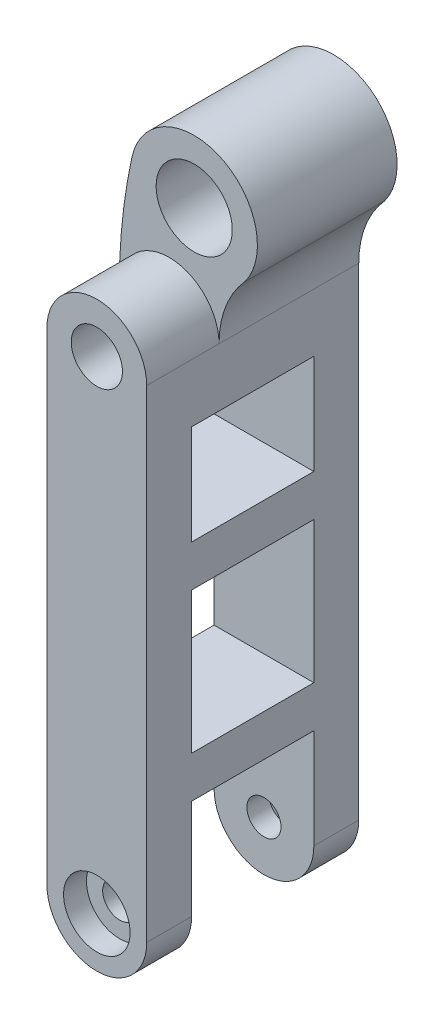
ISO-10303-21;
HEADER;
FILE_DESCRIPTION(('STEP AP214'),'2;1');
FILE_NAME('part.step','',(''),(''),'','','');
FILE_SCHEMA(('AUTOMOTIVE_DESIGN { 1 0 10303 214 1 1 1 1 }'));
ENDSEC;
DATA;
#1=APPLICATION_CONTEXT('core data for automotive mechanical design processes');
#2=APPLICATION_PROTOCOL_DEFINITION('international standard','automotive_design',2000,#1);
#3=PRODUCT_CONTEXT('',#1,'mechanical');
#4=PRODUCT('Part','Part','',(#3));
#5=PRODUCT_RELATED_PRODUCT_CATEGORY('part','',(#4));
#6=PRODUCT_DEFINITION_FORMATION('','',#4);
#7=PRODUCT_DEFINITION_CONTEXT('part definition',#1,'design');
#8=PRODUCT_DEFINITION('design','',#6,#7);
#9=PRODUCT_DEFINITION_SHAPE('','',#8);
#10=(LENGTH_UNIT() NAMED_UNIT(*) SI_UNIT(.MILLI.,.METRE.));
#11=(NAMED_UNIT(*) PLANE_ANGLE_UNIT() SI_UNIT($,.RADIAN.));
#12=(NAMED_UNIT(*) SI_UNIT($,.STERADIAN.) SOLID_ANGLE_UNIT());
#13=UNCERTAINTY_MEASURE_WITH_UNIT(LENGTH_MEASURE(1.E-05),#10,'distance_accuracy_value','');
#14=(GEOMETRIC_REPRESENTATION_CONTEXT(3) GLOBAL_UNCERTAINTY_ASSIGNED_CONTEXT((#13)) GLOBAL_UNIT_ASSIGNED_CONTEXT((#10,
#11,#12)) REPRESENTATION_CONTEXT('',''));
#15=CARTESIAN_POINT('',(0.,0.,0.));
#16=DIRECTION('',(0.,0.,1.));
#17=DIRECTION('',(1.,0.,0.));
#18=AXIS2_PLACEMENT_3D('',#15,#16,#17);
#19=CARTESIAN_POINT('',(6.,0.,-25.5));
#20=DIRECTION('',(0.,0.,1.));
#21=DIRECTION('',(1.,0.,0.));
#22=AXIS2_PLACEMENT_3D('',#19,#20,#21);
#23=CYLINDRICAL_SURFACE('',#22,2.05);
#24=CARTESIAN_POINT('',(6.,0.,-20.1));
#25=DIRECTION('',(0.,0.,-1.));
#26=DIRECTION('',(-1.,0.,0.));
#27=AXIS2_PLACEMENT_3D('',#24,#25,#26);
#28=CIRCLE('',#27,2.05);
#29=CARTESIAN_POINT('',(3.95,0.,-20.1));
#30=VERTEX_POINT('',#29);
#31=EDGE_CURVE('E313',#30,#30,#28,.F.);
#32=ORIENTED_EDGE('',*,*,#31,.T.);
#33=EDGE_LOOP('',(#32));
#34=FACE_BOUND('',#33,.T.);
#35=CARTESIAN_POINT('',(6.,0.,-22.75));
#36=DIRECTION('',(0.,0.,-1.));
#37=DIRECTION('',(-1.,0.,0.));
#38=AXIS2_PLACEMENT_3D('',#35,#36,#37);
#39=CIRCLE('',#38,2.05);
#40=CARTESIAN_POINT('',(3.95,0.,-22.75));
#41=VERTEX_POINT('',#40);
#42=EDGE_CURVE('E43',#41,#41,#39,.F.);
#43=ORIENTED_EDGE('',*,*,#42,.F.);
#44=EDGE_LOOP('',(#43));
#45=FACE_BOUND('',#44,.T.);
#46=ADVANCED_FACE('F39',(#34,#45),#23,.F.);
#47=CARTESIAN_POINT('',(6.,0.,-5.4));
#48=DIRECTION('',(0.,0.,1.));
#49=DIRECTION('',(1.,0.,0.));
#50=AXIS2_PLACEMENT_3D('',#47,#48,#49);
#51=CIRCLE('',#50,2.05);
#52=CARTESIAN_POINT('',(8.05,0.,-5.4));
#53=VERTEX_POINT('',#52);
#54=EDGE_CURVE('E358',#53,#53,#51,.F.);
#55=ORIENTED_EDGE('',*,*,#54,.T.);
#56=EDGE_LOOP('',(#55));
#57=FACE_BOUND('',#56,.T.);
#58=CARTESIAN_POINT('',(6.,0.,-2.75));
#59=DIRECTION('',(0.,0.,1.));
#60=DIRECTION('',(1.,0.,0.));
#61=AXIS2_PLACEMENT_3D('',#58,#59,#60);
#62=CIRCLE('',#61,2.05);
#63=CARTESIAN_POINT('',(8.05,0.,-2.75));
#64=VERTEX_POINT('',#63);
#65=EDGE_CURVE('E267',#64,#64,#62,.F.);
#66=ORIENTED_EDGE('',*,*,#65,.F.);
#67=EDGE_LOOP('',(#66));
#68=FACE_BOUND('',#67,.T.);
#69=ADVANCED_FACE('F427',(#57,#68),#23,.F.);
#70=CARTESIAN_POINT('',(5.99999999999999,58.,-25.5));
#71=DIRECTION('',(0.,0.,1.));
#72=DIRECTION('',(1.,0.,0.));
#73=AXIS2_PLACEMENT_3D('',#70,#71,#72);
#74=CYLINDRICAL_SURFACE('',#73,6.);
#75=DIRECTION('',(0.,0.,1.));
#76=VECTOR('',#75,1.);
#77=CARTESIAN_POINT('',(12.,58.,-25.5));
#78=LINE('',#77,#76);
#79=CARTESIAN_POINT('',(12.,58.,-8.7));
#80=VERTEX_POINT('',#79);
#81=CARTESIAN_POINT('',(12.,58.,0.));
#82=VERTEX_POINT('',#81);
#83=EDGE_CURVE('E415',#80,#82,#78,.T.);
#84=ORIENTED_EDGE('',*,*,#83,.F.);
#85=CARTESIAN_POINT('',(5.99999999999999,58.,-8.7));
#86=DIRECTION('',(0.,0.,-1.));
#87=DIRECTION('',(-1.,0.,0.));
#88=AXIS2_PLACEMENT_3D('',#85,#86,#87);
#89=CIRCLE('',#88,6.);
#90=CARTESIAN_POINT('',(0.,58.,-8.7));
#91=VERTEX_POINT('',#90);
#92=EDGE_CURVE('E296',#80,#91,#89,.F.);
#93=ORIENTED_EDGE('',*,*,#92,.T.);
#94=DIRECTION('',(0.,0.,1.));
#95=VECTOR('',#94,1.);
#96=CARTESIAN_POINT('',(0.,58.,-25.5));
#97=LINE('',#96,#95);
#98=CARTESIAN_POINT('',(0.,58.,0.));
#99=VERTEX_POINT('',#98);
#100=EDGE_CURVE('E411',#91,#99,#97,.T.);
#101=ORIENTED_EDGE('',*,*,#100,.T.);
#102=CARTESIAN_POINT('',(5.99999999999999,58.,0.));
#103=DIRECTION('',(0.,0.,1.));
#104=DIRECTION('',(-1.,0.,0.));
#105=AXIS2_PLACEMENT_3D('',#102,#103,#104);
#106=CIRCLE('',#105,6.);
#107=EDGE_CURVE('E404',#82,#99,#106,.T.);
#108=ORIENTED_EDGE('',*,*,#107,.F.);
#109=EDGE_LOOP('',(#84,#93,#101,#108));
#110=FACE_BOUND('',#109,.T.);
#111=ADVANCED_FACE('F429',(#110),#74,.T.);
#112=CARTESIAN_POINT('',(6.,0.,-25.5));
#113=DIRECTION('',(0.,0.,1.));
#114=DIRECTION('',(1.,0.,0.));
#115=AXIS2_PLACEMENT_3D('',#112,#113,#114);
#116=CYLINDRICAL_SURFACE('',#115,6.);
#117=CARTESIAN_POINT('',(6.,0.,-5.4));
#118=DIRECTION('',(0.,0.,1.));
#119=DIRECTION('',(1.,0.,0.));
#120=AXIS2_PLACEMENT_3D('',#117,#118,#119);
#121=CIRCLE('',#120,6.);
#122=CARTESIAN_POINT('',(12.,0.,-5.4));
#123=VERTEX_POINT('',#122);
#124=CARTESIAN_POINT('',(0.,0.,-5.4));
#125=VERTEX_POINT('',#124);
#126=EDGE_CURVE('E361',#123,#125,#121,.F.);
#127=ORIENTED_EDGE('',*,*,#126,.F.);
#128=DIRECTION('',(0.,0.,1.));
#129=VECTOR('',#128,1.);
#130=CARTESIAN_POINT('',(12.,0.,-25.5));
#131=LINE('',#130,#129);
#132=CARTESIAN_POINT('',(12.,0.,0.));
#133=VERTEX_POINT('',#132);
#134=EDGE_CURVE('E398',#123,#133,#131,.T.);
#135=ORIENTED_EDGE('',*,*,#134,.T.);
#136=CARTESIAN_POINT('',(6.,0.,0.));
#137=DIRECTION('',(0.,0.,1.));
#138=DIRECTION('',(-1.,0.,0.));
#139=AXIS2_PLACEMENT_3D('',#136,#137,#138);
#140=CIRCLE('',#139,6.);
#141=CARTESIAN_POINT('',(0.,0.,0.));
#142=VERTEX_POINT('',#141);
#143=EDGE_CURVE('E387',#142,#133,#140,.T.);
#144=ORIENTED_EDGE('',*,*,#143,.F.);
#145=DIRECTION('',(0.,0.,1.));
#146=VECTOR('',#145,1.);
#147=CARTESIAN_POINT('',(0.,0.,-25.5));
#148=LINE('',#147,#146);
#149=EDGE_CURVE('E48',#125,#142,#148,.T.);
#150=ORIENTED_EDGE('',*,*,#149,.F.);
#151=EDGE_LOOP('',(#127,#135,#144,#150));
#152=FACE_BOUND('',#151,.T.);
#153=ADVANCED_FACE('F436',(#152),#116,.T.);
#154=CARTESIAN_POINT('',(6.,0.,-20.1));
#155=DIRECTION('',(0.,0.,-1.));
#156=DIRECTION('',(-1.,0.,0.));
#157=AXIS2_PLACEMENT_3D('',#154,#155,#156);
#158=CIRCLE('',#157,6.);
#159=CARTESIAN_POINT('',(0.,0.,-20.1));
#160=VERTEX_POINT('',#159);
#161=CARTESIAN_POINT('',(12.,0.,-20.1));
#162=VERTEX_POINT('',#161);
#163=EDGE_CURVE('E356',#160,#162,#158,.F.);
#164=ORIENTED_EDGE('',*,*,#163,.F.);
#165=CARTESIAN_POINT('',(0.,0.,-25.5));
#166=VERTEX_POINT('',#165);
#167=EDGE_CURVE('E11',#166,#160,#148,.T.);
#168=ORIENTED_EDGE('',*,*,#167,.F.);
#169=CARTESIAN_POINT('',(6.,0.,-25.5));
#170=DIRECTION('',(0.,0.,1.));
#171=DIRECTION('',(-1.,0.,0.));
#172=AXIS2_PLACEMENT_3D('',#169,#170,#171);
#173=CIRCLE('',#172,6.);
#174=CARTESIAN_POINT('',(12.,0.,-25.5));
#175=VERTEX_POINT('',#174);
#176=EDGE_CURVE('E390',#166,#175,#173,.T.);
#177=ORIENTED_EDGE('',*,*,#176,.T.);
#178=EDGE_CURVE('E416',#175,#162,#131,.T.);
#179=ORIENTED_EDGE('',*,*,#178,.T.);
#180=EDGE_LOOP('',(#164,#168,#177,#179));
#181=FACE_BOUND('',#180,.T.);
#182=ADVANCED_FACE('F41',(#181),#116,.T.);
#183=CARTESIAN_POINT('',(0.,0.,-25.5));
#184=DIRECTION('',(-1.,0.,0.));
#185=DIRECTION('',(0.,-1.,0.));
#186=AXIS2_PLACEMENT_3D('',#183,#184,#185);
#187=PLANE('',#186);
#188=DIRECTION('',(0.,-1.,0.));
#189=VECTOR('',#188,1.);
#190=CARTESIAN_POINT('',(0.,0.,-25.5));
#191=LINE('',#190,#189);
#192=CARTESIAN_POINT('',(0.,58.,-25.5));
#193=VERTEX_POINT('',#192);
#194=EDGE_CURVE('E396',#193,#166,#191,.T.);
#195=ORIENTED_EDGE('',*,*,#194,.T.);
#196=ORIENTED_EDGE('',*,*,#167,.T.);
#197=DIRECTION('',(0.,-1.,0.));
#198=VECTOR('',#197,1.);
#199=CARTESIAN_POINT('',(0.,0.,-20.1));
#200=LINE('',#199,#198);
#201=CARTESIAN_POINT('',(0.,12.,-20.1));
#202=VERTEX_POINT('',#201);
#203=EDGE_CURVE('E353',#202,#160,#200,.T.);
#204=ORIENTED_EDGE('',*,*,#203,.F.);
#205=DIRECTION('',(0.,0.,-1.));
#206=VECTOR('',#205,1.);
#207=CARTESIAN_POINT('',(0.,12.,-25.5));
#208=LINE('',#207,#206);
#209=CARTESIAN_POINT('',(0.,12.,-5.4));
#210=VERTEX_POINT('',#209);
#211=EDGE_CURVE('E381',#210,#202,#208,.T.);
#212=ORIENTED_EDGE('',*,*,#211,.F.);
#213=DIRECTION('',(0.,1.,0.));
#214=VECTOR('',#213,1.);
#215=CARTESIAN_POINT('',(0.,0.,-5.4));
#216=LINE('',#215,#214);
#217=EDGE_CURVE('E359',#125,#210,#216,.T.);
#218=ORIENTED_EDGE('',*,*,#217,.F.);
#219=ORIENTED_EDGE('',*,*,#149,.T.);
#220=DIRECTION('',(0.,-1.,0.));
#221=VECTOR('',#220,1.);
#222=CARTESIAN_POINT('',(0.,0.,0.));
#223=LINE('',#222,#221);
#224=EDGE_CURVE('E394',#99,#142,#223,.T.);
#225=ORIENTED_EDGE('',*,*,#224,.F.);
#226=ORIENTED_EDGE('',*,*,#100,.F.);
#227=EDGE_CURVE('E409',#193,#91,#97,.T.);
#228=ORIENTED_EDGE('',*,*,#227,.F.);
#229=EDGE_LOOP('',(#195,#196,#204,#212,#218,#219,#225,#226,#228));
#230=FACE_BOUND('',#229,.T.);
#231=DIRECTION('',(0.,1.,0.));
#232=VECTOR('',#231,1.);
#233=CARTESIAN_POINT('',(0.,0.,-5.4));
#234=LINE('',#233,#232);
#235=CARTESIAN_POINT('',(0.,17.,-5.4));
#236=VERTEX_POINT('',#235);
#237=CARTESIAN_POINT('',(0.,34.,-5.4));
#238=VERTEX_POINT('',#237);
#239=EDGE_CURVE('E379',#236,#238,#234,.T.);
#240=ORIENTED_EDGE('',*,*,#239,.F.);
#241=DIRECTION('',(0.,0.,1.));
#242=VECTOR('',#241,1.);
#243=CARTESIAN_POINT('',(0.,17.,-25.5));
#244=LINE('',#243,#242);
#245=CARTESIAN_POINT('',(0.,17.,-20.1));
#246=VERTEX_POINT('',#245);
#247=EDGE_CURVE('E372',#246,#236,#244,.T.);
#248=ORIENTED_EDGE('',*,*,#247,.F.);
#249=DIRECTION('',(0.,-1.,0.));
#250=VECTOR('',#249,1.);
#251=CARTESIAN_POINT('',(0.,0.,-20.1));
#252=LINE('',#251,#250);
#253=CARTESIAN_POINT('',(0.,34.,-20.1));
#254=VERTEX_POINT('',#253);
#255=EDGE_CURVE('E374',#254,#246,#252,.T.);
#256=ORIENTED_EDGE('',*,*,#255,.F.);
#257=DIRECTION('',(0.,0.,-1.));
#258=VECTOR('',#257,1.);
#259=CARTESIAN_POINT('',(0.,34.,-25.5));
#260=LINE('',#259,#258);
#261=EDGE_CURVE('E377',#238,#254,#260,.T.);
#262=ORIENTED_EDGE('',*,*,#261,.F.);
#263=EDGE_LOOP('',(#240,#248,#256,#262));
#264=FACE_BOUND('',#263,.T.);
#265=DIRECTION('',(0.,1.,0.));
#266=VECTOR('',#265,1.);
#267=CARTESIAN_POINT('',(0.,0.,-5.4));
#268=LINE('',#267,#266);
#269=CARTESIAN_POINT('',(0.,39.,-5.4));
#270=VERTEX_POINT('',#269);
#271=CARTESIAN_POINT('',(0.,51.,-5.4));
#272=VERTEX_POINT('',#271);
#273=EDGE_CURVE('E370',#270,#272,#268,.T.);
#274=ORIENTED_EDGE('',*,*,#273,.F.);
#275=DIRECTION('',(0.,0.,1.));
#276=VECTOR('',#275,1.);
#277=CARTESIAN_POINT('',(0.,39.,-25.5));
#278=LINE('',#277,#276);
#279=CARTESIAN_POINT('',(0.,39.,-20.1));
#280=VERTEX_POINT('',#279);
#281=EDGE_CURVE('E363',#280,#270,#278,.T.);
#282=ORIENTED_EDGE('',*,*,#281,.F.);
#283=DIRECTION('',(0.,-1.,0.));
#284=VECTOR('',#283,1.);
#285=CARTESIAN_POINT('',(0.,0.,-20.1));
#286=LINE('',#285,#284);
#287=CARTESIAN_POINT('',(0.,51.,-20.1));
#288=VERTEX_POINT('',#287);
#289=EDGE_CURVE('E365',#288,#280,#286,.T.);
#290=ORIENTED_EDGE('',*,*,#289,.F.);
#291=DIRECTION('',(0.,0.,-1.));
#292=VECTOR('',#291,1.);
#293=CARTESIAN_POINT('',(0.,51.,-25.5));
#294=LINE('',#293,#292);
#295=EDGE_CURVE('E368',#272,#288,#294,.T.);
#296=ORIENTED_EDGE('',*,*,#295,.F.);
#297=EDGE_LOOP('',(#274,#282,#290,#296));
#298=FACE_BOUND('',#297,.T.);
#299=ADVANCED_FACE('F458',(#230,#264,#298),#187,.T.);
#300=CARTESIAN_POINT('',(12.,0.,-25.5));
#301=DIRECTION('',(1.,0.,0.));
#302=DIRECTION('',(0.,1.,0.));
#303=AXIS2_PLACEMENT_3D('',#300,#301,#302);
#304=PLANE('',#303);
#305=DIRECTION('',(0.,1.,0.));
#306=VECTOR('',#305,1.);
#307=CARTESIAN_POINT('',(12.,0.,-25.5));
#308=LINE('',#307,#306);
#309=CARTESIAN_POINT('',(12.,58.,-25.5));
#310=VERTEX_POINT('',#309);
#311=EDGE_CURVE('E393',#175,#310,#308,.T.);
#312=ORIENTED_EDGE('',*,*,#311,.T.);
#313=EDGE_CURVE('E412',#310,#80,#78,.T.);
#314=ORIENTED_EDGE('',*,*,#313,.T.);
#315=ORIENTED_EDGE('',*,*,#83,.T.);
#316=DIRECTION('',(0.,1.,0.));
#317=VECTOR('',#316,1.);
#318=CARTESIAN_POINT('',(12.,0.,0.));
#319=LINE('',#318,#317);
#320=EDGE_CURVE('E401',#133,#82,#319,.T.);
#321=ORIENTED_EDGE('',*,*,#320,.F.);
#322=ORIENTED_EDGE('',*,*,#134,.F.);
#323=DIRECTION('',(0.,-1.,0.));
#324=VECTOR('',#323,1.);
#325=CARTESIAN_POINT('',(12.,-6.,-5.4));
#326=LINE('',#325,#324);
#327=CARTESIAN_POINT('',(12.,12.,-5.4));
#328=VERTEX_POINT('',#327);
#329=EDGE_CURVE('E301',#328,#123,#326,.T.);
#330=ORIENTED_EDGE('',*,*,#329,.F.);
#331=DIRECTION('',(0.,0.,1.));
#332=VECTOR('',#331,1.);
#333=CARTESIAN_POINT('',(12.,12.,-5.4));
#334=LINE('',#333,#332);
#335=CARTESIAN_POINT('',(12.,12.,-20.1));
#336=VERTEX_POINT('',#335);
#337=EDGE_CURVE('E307',#336,#328,#334,.T.);
#338=ORIENTED_EDGE('',*,*,#337,.F.);
#339=DIRECTION('',(0.,1.,0.));
#340=VECTOR('',#339,1.);
#341=CARTESIAN_POINT('',(12.,-6.,-20.1));
#342=LINE('',#341,#340);
#343=EDGE_CURVE('E303',#162,#336,#342,.T.);
#344=ORIENTED_EDGE('',*,*,#343,.F.);
#345=ORIENTED_EDGE('',*,*,#178,.F.);
#346=EDGE_LOOP('',(#312,#314,#315,#321,#322,#330,#338,#344,#345));
#347=FACE_BOUND('',#346,.T.);
#348=DIRECTION('',(0.,-1.,0.));
#349=VECTOR('',#348,1.);
#350=CARTESIAN_POINT('',(12.,17.,-5.4));
#351=LINE('',#350,#349);
#352=CARTESIAN_POINT('',(12.,34.,-5.4));
#353=VERTEX_POINT('',#352);
#354=CARTESIAN_POINT('',(12.,17.,-5.4));
#355=VERTEX_POINT('',#354);
#356=EDGE_CURVE('E315',#353,#355,#351,.T.);
#357=ORIENTED_EDGE('',*,*,#356,.F.);
#358=DIRECTION('',(0.,0.,1.));
#359=VECTOR('',#358,1.);
#360=CARTESIAN_POINT('',(12.,34.,-5.4));
#361=LINE('',#360,#359);
#362=CARTESIAN_POINT('',(12.,34.,-20.1));
#363=VERTEX_POINT('',#362);
#364=EDGE_CURVE('E324',#363,#353,#361,.T.);
#365=ORIENTED_EDGE('',*,*,#364,.F.);
#366=DIRECTION('',(0.,1.,0.));
#367=VECTOR('',#366,1.);
#368=CARTESIAN_POINT('',(12.,17.,-20.1));
#369=LINE('',#368,#367);
#370=CARTESIAN_POINT('',(12.,17.,-20.1));
#371=VERTEX_POINT('',#370);
#372=EDGE_CURVE('E321',#371,#363,#369,.T.);
#373=ORIENTED_EDGE('',*,*,#372,.F.);
#374=DIRECTION('',(0.,0.,-1.));
#375=VECTOR('',#374,1.);
#376=CARTESIAN_POINT('',(12.,17.,-5.4));
#377=LINE('',#376,#375);
#378=EDGE_CURVE('E317',#355,#371,#377,.T.);
#379=ORIENTED_EDGE('',*,*,#378,.F.);
#380=EDGE_LOOP('',(#357,#365,#373,#379));
#381=FACE_BOUND('',#380,.T.);
#382=DIRECTION('',(0.,-1.,0.));
#383=VECTOR('',#382,1.);
#384=CARTESIAN_POINT('',(12.,39.,-5.4));
#385=LINE('',#384,#383);
#386=CARTESIAN_POINT('',(12.,51.,-5.4));
#387=VERTEX_POINT('',#386);
#388=CARTESIAN_POINT('',(12.,39.,-5.4));
#389=VERTEX_POINT('',#388);
#390=EDGE_CURVE('E300',#387,#389,#385,.T.);
#391=ORIENTED_EDGE('',*,*,#390,.F.);
#392=DIRECTION('',(0.,0.,1.));
#393=VECTOR('',#392,1.);
#394=CARTESIAN_POINT('',(12.,51.,-5.4));
#395=LINE('',#394,#393);
#396=CARTESIAN_POINT('',(12.,51.,-20.1));
#397=VERTEX_POINT('',#396);
#398=EDGE_CURVE('E342',#397,#387,#395,.T.);
#399=ORIENTED_EDGE('',*,*,#398,.F.);
#400=DIRECTION('',(0.,1.,0.));
#401=VECTOR('',#400,1.);
#402=CARTESIAN_POINT('',(12.,39.,-20.1));
#403=LINE('',#402,#401);
#404=CARTESIAN_POINT('',(12.,39.,-20.1));
#405=VERTEX_POINT('',#404);
#406=EDGE_CURVE('E339',#405,#397,#403,.T.);
#407=ORIENTED_EDGE('',*,*,#406,.F.);
#408=DIRECTION('',(0.,0.,-1.));
#409=VECTOR('',#408,1.);
#410=CARTESIAN_POINT('',(12.,39.,-5.4));
#411=LINE('',#410,#409);
#412=EDGE_CURVE('E336',#389,#405,#411,.T.);
#413=ORIENTED_EDGE('',*,*,#412,.F.);
#414=EDGE_LOOP('',(#391,#399,#407,#413));
#415=FACE_BOUND('',#414,.T.);
#416=ADVANCED_FACE('F453',(#347,#381,#415),#304,.T.);
#417=CARTESIAN_POINT('',(6.,0.,-25.5));
#418=DIRECTION('',(0.,0.,-1.));
#419=DIRECTION('',(-1.,0.,0.));
#420=AXIS2_PLACEMENT_3D('',#417,#418,#419);
#421=PLANE('',#420);
#422=DIRECTION('',(-0.5,0.866025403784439,0.));
#423=VECTOR('',#422,1.);
#424=CARTESIAN_POINT('',(4.,-3.46410161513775,-25.5));
#425=LINE('',#424,#423);
#426=CARTESIAN_POINT('',(4.,-3.46410161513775,-25.5));
#427=VERTEX_POINT('',#426);
#428=CARTESIAN_POINT('',(2.,0.,-25.5));
#429=VERTEX_POINT('',#428);
#430=EDGE_CURVE('E56',#427,#429,#425,.T.);
#431=ORIENTED_EDGE('',*,*,#430,.F.);
#432=DIRECTION('',(-1.,0.,0.));
#433=VECTOR('',#432,1.);
#434=CARTESIAN_POINT('',(8.,-3.46410161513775,-25.5));
#435=LINE('',#434,#433);
#436=CARTESIAN_POINT('',(8.,-3.46410161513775,-25.5));
#437=VERTEX_POINT('',#436);
#438=EDGE_CURVE('E231',#437,#427,#435,.T.);
#439=ORIENTED_EDGE('',*,*,#438,.F.);
#440=DIRECTION('',(-0.5,-0.866025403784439,0.));
#441=VECTOR('',#440,1.);
#442=CARTESIAN_POINT('',(10.,0.,-25.5));
#443=LINE('',#442,#441);
#444=CARTESIAN_POINT('',(10.,0.,-25.5));
#445=VERTEX_POINT('',#444);
#446=EDGE_CURVE('E234',#445,#437,#443,.T.);
#447=ORIENTED_EDGE('',*,*,#446,.F.);
#448=DIRECTION('',(0.5,-0.866025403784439,0.));
#449=VECTOR('',#448,1.);
#450=CARTESIAN_POINT('',(8.,3.46410161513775,-25.5));
#451=LINE('',#450,#449);
#452=CARTESIAN_POINT('',(8.,3.46410161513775,-25.5));
#453=VERTEX_POINT('',#452);
#454=EDGE_CURVE('E250',#453,#445,#451,.T.);
#455=ORIENTED_EDGE('',*,*,#454,.F.);
#456=DIRECTION('',(1.,0.,0.));
#457=VECTOR('',#456,1.);
#458=CARTESIAN_POINT('',(4.,3.46410161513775,-25.5));
#459=LINE('',#458,#457);
#460=CARTESIAN_POINT('',(4.,3.46410161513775,-25.5));
#461=VERTEX_POINT('',#460);
#462=EDGE_CURVE('E247',#461,#453,#459,.T.);
#463=ORIENTED_EDGE('',*,*,#462,.F.);
#464=DIRECTION('',(0.5,0.866025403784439,0.));
#465=VECTOR('',#464,1.);
#466=CARTESIAN_POINT('',(2.,0.,-25.5));
#467=LINE('',#466,#465);
#468=EDGE_CURVE('E245',#429,#461,#467,.T.);
#469=ORIENTED_EDGE('',*,*,#468,.F.);
#470=EDGE_LOOP('',(#431,#439,#447,#455,#463,#469));
#471=FACE_BOUND('',#470,.T.);
#472=ORIENTED_EDGE('',*,*,#176,.F.);
#473=ORIENTED_EDGE('',*,*,#194,.F.);
#474=CARTESIAN_POINT('',(66.9904849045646,58.,-25.5));
#475=DIRECTION('',(0.,0.,-1.));
#476=DIRECTION('',(-1.,0.,0.));
#477=AXIS2_PLACEMENT_3D('',#474,#475,#476);
#478=CIRCLE('',#477,66.9904849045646);
#479=CARTESIAN_POINT('',(1.52080327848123,72.1931622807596,-25.5));
#480=VERTEX_POINT('',#479);
#481=EDGE_CURVE('E277',#193,#480,#478,.T.);
#482=ORIENTED_EDGE('',*,*,#481,.T.);
#483=CARTESIAN_POINT('',(8.98072478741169,70.5759270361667,-25.5));
#484=DIRECTION('',(0.,0.,-1.));
#485=DIRECTION('',(-1.,0.,0.));
#486=AXIS2_PLACEMENT_3D('',#483,#484,#485);
#487=CIRCLE('',#486,7.63320894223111);
#488=CARTESIAN_POINT('',(15.0877709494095,65.9966404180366,-25.5));
#489=VERTEX_POINT('',#488);
#490=EDGE_CURVE('E280',#480,#489,#487,.T.);
#491=ORIENTED_EDGE('',*,*,#490,.T.);
#492=CARTESIAN_POINT('',(23.8986460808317,58.,-25.5));
#493=DIRECTION('',(0.,0.,1.));
#494=DIRECTION('',(-1.,0.,0.));
#495=AXIS2_PLACEMENT_3D('',#492,#493,#494);
#496=CIRCLE('',#495,11.8986460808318);
#497=EDGE_CURVE('E274',#489,#310,#496,.T.);
#498=ORIENTED_EDGE('',*,*,#497,.T.);
#499=ORIENTED_EDGE('',*,*,#311,.F.);
#500=EDGE_LOOP('',(#472,#473,#482,#491,#498,#499));
#501=FACE_BOUND('',#500,.T.);
#502=CARTESIAN_POINT('',(5.99999999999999,58.,-25.5));
#503=DIRECTION('',(0.,0.,1.));
#504=DIRECTION('',(1.,0.,0.));
#505=AXIS2_PLACEMENT_3D('',#502,#503,#504);
#506=CIRCLE('',#505,3.08);
#507=CARTESIAN_POINT('',(9.07999999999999,58.,-25.5));
#508=VERTEX_POINT('',#507);
#509=EDGE_CURVE('E384',#508,#508,#506,.T.);
#510=ORIENTED_EDGE('',*,*,#509,.T.);
#511=EDGE_LOOP('',(#510));
#512=FACE_BOUND('',#511,.T.);
#513=CARTESIAN_POINT('',(9.01270872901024,70.6459542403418,-25.5));
#514=DIRECTION('',(0.,0.,-1.));
#515=DIRECTION('',(-1.,0.,0.));
#516=AXIS2_PLACEMENT_3D('',#513,#514,#515);
#517=CIRCLE('',#516,4.58);
#518=CARTESIAN_POINT('',(4.43270872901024,70.6459542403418,-25.5));
#519=VERTEX_POINT('',#518);
#520=EDGE_CURVE('E271',#519,#519,#517,.T.);
#521=ORIENTED_EDGE('',*,*,#520,.F.);
#522=EDGE_LOOP('',(#521));
#523=FACE_BOUND('',#522,.T.);
#524=ADVANCED_FACE('F450',(#471,#501,#512,#523),#421,.T.);
#525=CARTESIAN_POINT('',(6.,0.,0.));
#526=DIRECTION('',(0.,0.,-1.));
#527=DIRECTION('',(-1.,0.,0.));
#528=AXIS2_PLACEMENT_3D('',#525,#526,#527);
#529=PLANE('',#528);
#530=CARTESIAN_POINT('',(6.,0.,0.));
#531=DIRECTION('',(0.,0.,1.));
#532=DIRECTION('',(1.,0.,0.));
#533=AXIS2_PLACEMENT_3D('',#530,#531,#532);
#534=CIRCLE('',#533,4.);
#535=CARTESIAN_POINT('',(10.,0.,0.));
#536=VERTEX_POINT('',#535);
#537=EDGE_CURVE('E268',#536,#536,#534,.T.);
#538=ORIENTED_EDGE('',*,*,#537,.F.);
#539=EDGE_LOOP('',(#538));
#540=FACE_BOUND('',#539,.T.);
#541=CARTESIAN_POINT('',(5.99999999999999,58.,0.));
#542=DIRECTION('',(0.,0.,1.));
#543=DIRECTION('',(1.,0.,0.));
#544=AXIS2_PLACEMENT_3D('',#541,#542,#543);
#545=CIRCLE('',#544,3.08);
#546=CARTESIAN_POINT('',(9.07999999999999,58.,0.));
#547=VERTEX_POINT('',#546);
#548=EDGE_CURVE('E383',#547,#547,#545,.T.);
#549=ORIENTED_EDGE('',*,*,#548,.F.);
#550=EDGE_LOOP('',(#549));
#551=FACE_BOUND('',#550,.T.);
#552=ORIENTED_EDGE('',*,*,#143,.T.);
#553=ORIENTED_EDGE('',*,*,#320,.T.);
#554=ORIENTED_EDGE('',*,*,#107,.T.);
#555=ORIENTED_EDGE('',*,*,#224,.T.);
#556=EDGE_LOOP('',(#552,#553,#554,#555));
#557=FACE_BOUND('',#556,.T.);
#558=ADVANCED_FACE('F448',(#540,#551,#557),#529,.F.);
#559=CARTESIAN_POINT('',(5.99999999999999,58.,-25.5));
#560=DIRECTION('',(0.,0.,1.));
#561=DIRECTION('',(1.,0.,0.));
#562=AXIS2_PLACEMENT_3D('',#559,#560,#561);
#563=CYLINDRICAL_SURFACE('',#562,3.08);
#564=ORIENTED_EDGE('',*,*,#509,.F.);
#565=EDGE_LOOP('',(#564));
#566=FACE_BOUND('',#565,.T.);
#567=ORIENTED_EDGE('',*,*,#548,.T.);
#568=EDGE_LOOP('',(#567));
#569=FACE_BOUND('',#568,.T.);
#570=ADVANCED_FACE('F444',(#566,#569),#563,.F.);
#571=CARTESIAN_POINT('',(-8.,-6.,-5.4));
#572=DIRECTION('',(0.,0.,1.));
#573=DIRECTION('',(1.,0.,0.));
#574=AXIS2_PLACEMENT_3D('',#571,#572,#573);
#575=PLANE('',#574);
#576=ORIENTED_EDGE('',*,*,#126,.T.);
#577=ORIENTED_EDGE('',*,*,#217,.T.);
#578=DIRECTION('',(1.,0.,0.));
#579=VECTOR('',#578,1.);
#580=CARTESIAN_POINT('',(-8.,12.,-5.4));
#581=LINE('',#580,#579);
#582=EDGE_CURVE('E311',#210,#328,#581,.T.);
#583=ORIENTED_EDGE('',*,*,#582,.T.);
#584=ORIENTED_EDGE('',*,*,#329,.T.);
#585=EDGE_LOOP('',(#576,#577,#583,#584));
#586=FACE_BOUND('',#585,.T.);
#587=ORIENTED_EDGE('',*,*,#54,.F.);
#588=EDGE_LOOP('',(#587));
#589=FACE_BOUND('',#588,.T.);
#590=ADVANCED_FACE('F447',(#586,#589),#575,.F.);
#591=CARTESIAN_POINT('',(-8.,-6.,-20.1));
#592=DIRECTION('',(0.,0.,-1.));
#593=DIRECTION('',(-1.,0.,0.));
#594=AXIS2_PLACEMENT_3D('',#591,#592,#593);
#595=PLANE('',#594);
#596=ORIENTED_EDGE('',*,*,#163,.T.);
#597=ORIENTED_EDGE('',*,*,#343,.T.);
#598=DIRECTION('',(1.,0.,0.));
#599=VECTOR('',#598,1.);
#600=CARTESIAN_POINT('',(-8.,12.,-20.1));
#601=LINE('',#600,#599);
#602=EDGE_CURVE('E310',#202,#336,#601,.T.);
#603=ORIENTED_EDGE('',*,*,#602,.F.);
#604=ORIENTED_EDGE('',*,*,#203,.T.);
#605=EDGE_LOOP('',(#596,#597,#603,#604));
#606=FACE_BOUND('',#605,.T.);
#607=ORIENTED_EDGE('',*,*,#31,.F.);
#608=EDGE_LOOP('',(#607));
#609=FACE_BOUND('',#608,.T.);
#610=ADVANCED_FACE('F517',(#606,#609),#595,.F.);
#611=CARTESIAN_POINT('',(-8.,12.,-5.4));
#612=DIRECTION('',(0.,1.,0.));
#613=DIRECTION('',(-1.,0.,0.));
#614=AXIS2_PLACEMENT_3D('',#611,#612,#613);
#615=PLANE('',#614);
#616=ORIENTED_EDGE('',*,*,#211,.T.);
#617=ORIENTED_EDGE('',*,*,#602,.T.);
#618=ORIENTED_EDGE('',*,*,#337,.T.);
#619=ORIENTED_EDGE('',*,*,#582,.F.);
#620=EDGE_LOOP('',(#616,#617,#618,#619));
#621=FACE_BOUND('',#620,.T.);
#622=ADVANCED_FACE('F521',(#621),#615,.F.);
#623=CARTESIAN_POINT('',(-8.00000000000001,39.,-5.4));
#624=DIRECTION('',(0.,0.,1.));
#625=DIRECTION('',(1.,0.,0.));
#626=AXIS2_PLACEMENT_3D('',#623,#624,#625);
#627=PLANE('',#626);
#628=ORIENTED_EDGE('',*,*,#273,.T.);
#629=DIRECTION('',(1.,0.,0.));
#630=VECTOR('',#629,1.);
#631=CARTESIAN_POINT('',(-8.00000000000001,51.,-5.4));
#632=LINE('',#631,#630);
#633=EDGE_CURVE('E318',#272,#387,#632,.T.);
#634=ORIENTED_EDGE('',*,*,#633,.T.);
#635=ORIENTED_EDGE('',*,*,#390,.T.);
#636=DIRECTION('',(1.,0.,0.));
#637=VECTOR('',#636,1.);
#638=CARTESIAN_POINT('',(-8.00000000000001,39.,-5.4));
#639=LINE('',#638,#637);
#640=EDGE_CURVE('E345',#270,#389,#639,.T.);
#641=ORIENTED_EDGE('',*,*,#640,.F.);
#642=EDGE_LOOP('',(#628,#634,#635,#641));
#643=FACE_BOUND('',#642,.T.);
#644=ADVANCED_FACE('F442',(#643),#627,.F.);
#645=CARTESIAN_POINT('',(-8.00000000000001,51.,-5.4));
#646=DIRECTION('',(0.,1.,0.));
#647=DIRECTION('',(-1.,0.,0.));
#648=AXIS2_PLACEMENT_3D('',#645,#646,#647);
#649=PLANE('',#648);
#650=ORIENTED_EDGE('',*,*,#295,.T.);
#651=DIRECTION('',(1.,0.,0.));
#652=VECTOR('',#651,1.);
#653=CARTESIAN_POINT('',(-8.00000000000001,51.,-20.1));
#654=LINE('',#653,#652);
#655=EDGE_CURVE('E347',#288,#397,#654,.T.);
#656=ORIENTED_EDGE('',*,*,#655,.T.);
#657=ORIENTED_EDGE('',*,*,#398,.T.);
#658=ORIENTED_EDGE('',*,*,#633,.F.);
#659=EDGE_LOOP('',(#650,#656,#657,#658));
#660=FACE_BOUND('',#659,.T.);
#661=ADVANCED_FACE('F486',(#660),#649,.F.);
#662=CARTESIAN_POINT('',(-8.00000000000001,39.,-20.1));
#663=DIRECTION('',(0.,0.,-1.));
#664=DIRECTION('',(-1.,0.,0.));
#665=AXIS2_PLACEMENT_3D('',#662,#663,#664);
#666=PLANE('',#665);
#667=ORIENTED_EDGE('',*,*,#289,.T.);
#668=DIRECTION('',(1.,0.,0.));
#669=VECTOR('',#668,1.);
#670=CARTESIAN_POINT('',(-8.00000000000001,39.,-20.1));
#671=LINE('',#670,#669);
#672=EDGE_CURVE('E349',#280,#405,#671,.T.);
#673=ORIENTED_EDGE('',*,*,#672,.T.);
#674=ORIENTED_EDGE('',*,*,#406,.T.);
#675=ORIENTED_EDGE('',*,*,#655,.F.);
#676=EDGE_LOOP('',(#667,#673,#674,#675));
#677=FACE_BOUND('',#676,.T.);
#678=ADVANCED_FACE('F489',(#677),#666,.F.);
#679=CARTESIAN_POINT('',(-8.00000000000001,39.,-5.4));
#680=DIRECTION('',(0.,-1.,0.));
#681=DIRECTION('',(1.,0.,0.));
#682=AXIS2_PLACEMENT_3D('',#679,#680,#681);
#683=PLANE('',#682);
#684=ORIENTED_EDGE('',*,*,#281,.T.);
#685=ORIENTED_EDGE('',*,*,#640,.T.);
#686=ORIENTED_EDGE('',*,*,#412,.T.);
#687=ORIENTED_EDGE('',*,*,#672,.F.);
#688=EDGE_LOOP('',(#684,#685,#686,#687));
#689=FACE_BOUND('',#688,.T.);
#690=ADVANCED_FACE('F480',(#689),#683,.F.);
#691=CARTESIAN_POINT('',(-8.,17.,-5.4));
#692=DIRECTION('',(0.,0.,1.));
#693=DIRECTION('',(1.,0.,0.));
#694=AXIS2_PLACEMENT_3D('',#691,#692,#693);
#695=PLANE('',#694);
#696=ORIENTED_EDGE('',*,*,#239,.T.);
#697=DIRECTION('',(1.,0.,0.));
#698=VECTOR('',#697,1.);
#699=CARTESIAN_POINT('',(-8.00000000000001,34.,-5.4));
#700=LINE('',#699,#698);
#701=EDGE_CURVE('E304',#238,#353,#700,.T.);
#702=ORIENTED_EDGE('',*,*,#701,.T.);
#703=ORIENTED_EDGE('',*,*,#356,.T.);
#704=DIRECTION('',(1.,0.,0.));
#705=VECTOR('',#704,1.);
#706=CARTESIAN_POINT('',(-8.,17.,-5.4));
#707=LINE('',#706,#705);
#708=EDGE_CURVE('E327',#236,#355,#707,.T.);
#709=ORIENTED_EDGE('',*,*,#708,.F.);
#710=EDGE_LOOP('',(#696,#702,#703,#709));
#711=FACE_BOUND('',#710,.T.);
#712=ADVANCED_FACE('F496',(#711),#695,.F.);
#713=CARTESIAN_POINT('',(-8.00000000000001,34.,-5.4));
#714=DIRECTION('',(0.,1.,0.));
#715=DIRECTION('',(-1.,0.,0.));
#716=AXIS2_PLACEMENT_3D('',#713,#714,#715);
#717=PLANE('',#716);
#718=ORIENTED_EDGE('',*,*,#261,.T.);
#719=DIRECTION('',(1.,0.,0.));
#720=VECTOR('',#719,1.);
#721=CARTESIAN_POINT('',(-8.00000000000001,34.,-20.1));
#722=LINE('',#721,#720);
#723=EDGE_CURVE('E329',#254,#363,#722,.T.);
#724=ORIENTED_EDGE('',*,*,#723,.T.);
#725=ORIENTED_EDGE('',*,*,#364,.T.);
#726=ORIENTED_EDGE('',*,*,#701,.F.);
#727=EDGE_LOOP('',(#718,#724,#725,#726));
#728=FACE_BOUND('',#727,.T.);
#729=ADVANCED_FACE('F501',(#728),#717,.F.);
#730=CARTESIAN_POINT('',(-8.,17.,-20.1));
#731=DIRECTION('',(0.,0.,-1.));
#732=DIRECTION('',(0.,1.,0.));
#733=AXIS2_PLACEMENT_3D('',#730,#731,#732);
#734=PLANE('',#733);
#735=ORIENTED_EDGE('',*,*,#255,.T.);
#736=DIRECTION('',(1.,0.,0.));
#737=VECTOR('',#736,1.);
#738=CARTESIAN_POINT('',(-8.,17.,-20.1));
#739=LINE('',#738,#737);
#740=EDGE_CURVE('E331',#246,#371,#739,.T.);
#741=ORIENTED_EDGE('',*,*,#740,.T.);
#742=ORIENTED_EDGE('',*,*,#372,.T.);
#743=ORIENTED_EDGE('',*,*,#723,.F.);
#744=EDGE_LOOP('',(#735,#741,#742,#743));
#745=FACE_BOUND('',#744,.T.);
#746=ADVANCED_FACE('F507',(#745),#734,.F.);
#747=CARTESIAN_POINT('',(-8.,17.,-5.4));
#748=DIRECTION('',(0.,-1.,0.));
#749=DIRECTION('',(1.,0.,0.));
#750=AXIS2_PLACEMENT_3D('',#747,#748,#749);
#751=PLANE('',#750);
#752=ORIENTED_EDGE('',*,*,#247,.T.);
#753=ORIENTED_EDGE('',*,*,#708,.T.);
#754=ORIENTED_EDGE('',*,*,#378,.T.);
#755=ORIENTED_EDGE('',*,*,#740,.F.);
#756=EDGE_LOOP('',(#752,#753,#754,#755));
#757=FACE_BOUND('',#756,.T.);
#758=ADVANCED_FACE('F503',(#757),#751,.F.);
#759=CARTESIAN_POINT('',(23.8986460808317,58.,-8.7));
#760=DIRECTION('',(0.,0.,-1.));
#761=DIRECTION('',(-1.,0.,0.));
#762=AXIS2_PLACEMENT_3D('',#759,#760,#761);
#763=CYLINDRICAL_SURFACE('',#762,11.8986460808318);
#764=ORIENTED_EDGE('',*,*,#313,.F.);
#765=ORIENTED_EDGE('',*,*,#497,.F.);
#766=DIRECTION('',(0.,0.,-1.));
#767=VECTOR('',#766,1.);
#768=CARTESIAN_POINT('',(15.0877709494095,65.9966404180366,-8.7));
#769=LINE('',#768,#767);
#770=CARTESIAN_POINT('',(15.0877709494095,65.9966404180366,-8.7));
#771=VERTEX_POINT('',#770);
#772=EDGE_CURVE('E294',#771,#489,#769,.T.);
#773=ORIENTED_EDGE('',*,*,#772,.F.);
#774=CARTESIAN_POINT('',(23.8986460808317,58.,-8.7));
#775=DIRECTION('',(0.,0.,1.));
#776=DIRECTION('',(-1.,0.,0.));
#777=AXIS2_PLACEMENT_3D('',#774,#775,#776);
#778=CIRCLE('',#777,11.8986460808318);
#779=EDGE_CURVE('E64',#771,#80,#778,.T.);
#780=ORIENTED_EDGE('',*,*,#779,.T.);
#781=EDGE_LOOP('',(#764,#765,#773,#780));
#782=FACE_BOUND('',#781,.T.);
#783=ADVANCED_FACE('F506',(#782),#763,.F.);
#784=CARTESIAN_POINT('',(8.98072478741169,70.5759270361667,-8.7));
#785=DIRECTION('',(0.,0.,-1.));
#786=DIRECTION('',(-1.,0.,0.));
#787=AXIS2_PLACEMENT_3D('',#784,#785,#786);
#788=CYLINDRICAL_SURFACE('',#787,7.63320894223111);
#789=ORIENTED_EDGE('',*,*,#772,.T.);
#790=ORIENTED_EDGE('',*,*,#490,.F.);
#791=DIRECTION('',(0.,0.,-1.));
#792=VECTOR('',#791,1.);
#793=CARTESIAN_POINT('',(1.52080327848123,72.1931622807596,-8.7));
#794=LINE('',#793,#792);
#795=CARTESIAN_POINT('',(1.52080327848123,72.1931622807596,-8.7));
#796=VERTEX_POINT('',#795);
#797=EDGE_CURVE('E293',#796,#480,#794,.T.);
#798=ORIENTED_EDGE('',*,*,#797,.F.);
#799=CARTESIAN_POINT('',(8.98072478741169,70.5759270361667,-8.7));
#800=DIRECTION('',(0.,0.,-1.));
#801=DIRECTION('',(-1.,0.,0.));
#802=AXIS2_PLACEMENT_3D('',#799,#800,#801);
#803=CIRCLE('',#802,7.63320894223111);
#804=EDGE_CURVE('E290',#796,#771,#803,.T.);
#805=ORIENTED_EDGE('',*,*,#804,.T.);
#806=EDGE_LOOP('',(#789,#790,#798,#805));
#807=FACE_BOUND('',#806,.T.);
#808=ADVANCED_FACE('F528',(#807),#788,.T.);
#809=CARTESIAN_POINT('',(66.9904849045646,58.,-8.7));
#810=DIRECTION('',(0.,0.,-1.));
#811=DIRECTION('',(-1.,0.,0.));
#812=AXIS2_PLACEMENT_3D('',#809,#810,#811);
#813=CYLINDRICAL_SURFACE('',#812,66.9904849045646);
#814=ORIENTED_EDGE('',*,*,#797,.T.);
#815=ORIENTED_EDGE('',*,*,#481,.F.);
#816=ORIENTED_EDGE('',*,*,#227,.T.);
#817=CARTESIAN_POINT('',(66.9904849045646,58.,-8.7));
#818=DIRECTION('',(0.,0.,-1.));
#819=DIRECTION('',(-1.,0.,0.));
#820=AXIS2_PLACEMENT_3D('',#817,#818,#819);
#821=CIRCLE('',#820,66.9904849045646);
#822=EDGE_CURVE('E287',#91,#796,#821,.T.);
#823=ORIENTED_EDGE('',*,*,#822,.T.);
#824=EDGE_LOOP('',(#814,#815,#816,#823));
#825=FACE_BOUND('',#824,.T.);
#826=ADVANCED_FACE('F529',(#825),#813,.T.);
#827=CARTESIAN_POINT('',(23.8986460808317,58.,-8.7));
#828=DIRECTION('',(0.,0.,-1.));
#829=DIRECTION('',(-1.,0.,0.));
#830=AXIS2_PLACEMENT_3D('',#827,#828,#829);
#831=PLANE('',#830);
#832=ORIENTED_EDGE('',*,*,#92,.F.);
#833=ORIENTED_EDGE('',*,*,#779,.F.);
#834=ORIENTED_EDGE('',*,*,#804,.F.);
#835=ORIENTED_EDGE('',*,*,#822,.F.);
#836=EDGE_LOOP('',(#832,#833,#834,#835));
#837=FACE_BOUND('',#836,.T.);
#838=CARTESIAN_POINT('',(9.01270872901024,70.6459542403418,-8.7));
#839=DIRECTION('',(0.,0.,-1.));
#840=DIRECTION('',(-1.,0.,0.));
#841=AXIS2_PLACEMENT_3D('',#838,#839,#840);
#842=CIRCLE('',#841,4.58);
#843=CARTESIAN_POINT('',(4.43270872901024,70.6459542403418,-8.7));
#844=VERTEX_POINT('',#843);
#845=EDGE_CURVE('E283',#844,#844,#842,.T.);
#846=ORIENTED_EDGE('',*,*,#845,.T.);
#847=EDGE_LOOP('',(#846));
#848=FACE_BOUND('',#847,.T.);
#849=ADVANCED_FACE('F532',(#837,#848),#831,.F.);
#850=CARTESIAN_POINT('',(9.01270872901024,70.6459542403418,-8.7));
#851=DIRECTION('',(0.,0.,-1.));
#852=DIRECTION('',(-1.,0.,0.));
#853=AXIS2_PLACEMENT_3D('',#850,#851,#852);
#854=CYLINDRICAL_SURFACE('',#853,4.58);
#855=ORIENTED_EDGE('',*,*,#845,.F.);
#856=EDGE_LOOP('',(#855));
#857=FACE_BOUND('',#856,.T.);
#858=ORIENTED_EDGE('',*,*,#520,.T.);
#859=EDGE_LOOP('',(#858));
#860=FACE_BOUND('',#859,.T.);
#861=ADVANCED_FACE('F539',(#857,#860),#854,.F.);
#862=CARTESIAN_POINT('',(6.,0.,-2.75));
#863=DIRECTION('',(0.,0.,1.));
#864=DIRECTION('',(1.,0.,0.));
#865=AXIS2_PLACEMENT_3D('',#862,#863,#864);
#866=PLANE('',#865);
#867=CARTESIAN_POINT('',(6.,0.,-2.75));
#868=DIRECTION('',(0.,0.,1.));
#869=DIRECTION('',(1.,0.,0.));
#870=AXIS2_PLACEMENT_3D('',#867,#868,#869);
#871=CIRCLE('',#870,4.);
#872=CARTESIAN_POINT('',(10.,0.,-2.75));
#873=VERTEX_POINT('',#872);
#874=EDGE_CURVE('E264',#873,#873,#871,.T.);
#875=ORIENTED_EDGE('',*,*,#874,.T.);
#876=EDGE_LOOP('',(#875));
#877=FACE_BOUND('',#876,.T.);
#878=ORIENTED_EDGE('',*,*,#65,.T.);
#879=EDGE_LOOP('',(#878));
#880=FACE_BOUND('',#879,.T.);
#881=ADVANCED_FACE('F425',(#877,#880),#866,.T.);
#882=CARTESIAN_POINT('',(6.,0.,-2.75));
#883=DIRECTION('',(0.,0.,1.));
#884=DIRECTION('',(1.,0.,0.));
#885=AXIS2_PLACEMENT_3D('',#882,#883,#884);
#886=CYLINDRICAL_SURFACE('',#885,4.);
#887=ORIENTED_EDGE('',*,*,#874,.F.);
#888=EDGE_LOOP('',(#887));
#889=FACE_BOUND('',#888,.T.);
#890=ORIENTED_EDGE('',*,*,#537,.T.);
#891=EDGE_LOOP('',(#890));
#892=FACE_BOUND('',#891,.T.);
#893=ADVANCED_FACE('F544',(#889,#892),#886,.F.);
#894=CARTESIAN_POINT('',(0.,0.,-22.75));
#895=DIRECTION('',(0.,0.,-1.));
#896=DIRECTION('',(-1.,0.,0.));
#897=AXIS2_PLACEMENT_3D('',#894,#895,#896);
#898=PLANE('',#897);
#899=DIRECTION('',(-0.5,0.866025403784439,0.));
#900=VECTOR('',#899,1.);
#901=CARTESIAN_POINT('',(4.,-3.46410161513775,-22.75));
#902=LINE('',#901,#900);
#903=CARTESIAN_POINT('',(4.,-3.46410161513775,-22.75));
#904=VERTEX_POINT('',#903);
#905=CARTESIAN_POINT('',(2.,0.,-22.75));
#906=VERTEX_POINT('',#905);
#907=EDGE_CURVE('E211',#904,#906,#902,.T.);
#908=ORIENTED_EDGE('',*,*,#907,.T.);
#909=DIRECTION('',(0.5,0.866025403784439,0.));
#910=VECTOR('',#909,1.);
#911=CARTESIAN_POINT('',(2.,0.,-22.75));
#912=LINE('',#911,#910);
#913=CARTESIAN_POINT('',(4.,3.46410161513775,-22.75));
#914=VERTEX_POINT('',#913);
#915=EDGE_CURVE('E220',#906,#914,#912,.T.);
#916=ORIENTED_EDGE('',*,*,#915,.T.);
#917=DIRECTION('',(1.,0.,0.));
#918=VECTOR('',#917,1.);
#919=CARTESIAN_POINT('',(4.,3.46410161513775,-22.75));
#920=LINE('',#919,#918);
#921=CARTESIAN_POINT('',(8.,3.46410161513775,-22.75));
#922=VERTEX_POINT('',#921);
#923=EDGE_CURVE('E225',#914,#922,#920,.T.);
#924=ORIENTED_EDGE('',*,*,#923,.T.);
#925=DIRECTION('',(0.5,-0.866025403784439,0.));
#926=VECTOR('',#925,1.);
#927=CARTESIAN_POINT('',(8.,3.46410161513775,-22.75));
#928=LINE('',#927,#926);
#929=CARTESIAN_POINT('',(10.,0.,-22.75));
#930=VERTEX_POINT('',#929);
#931=EDGE_CURVE('E238',#922,#930,#928,.T.);
#932=ORIENTED_EDGE('',*,*,#931,.T.);
#933=DIRECTION('',(-0.5,-0.866025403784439,0.));
#934=VECTOR('',#933,1.);
#935=CARTESIAN_POINT('',(10.,0.,-22.75));
#936=LINE('',#935,#934);
#937=CARTESIAN_POINT('',(8.,-3.46410161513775,-22.75));
#938=VERTEX_POINT('',#937);
#939=EDGE_CURVE('E241',#930,#938,#936,.T.);
#940=ORIENTED_EDGE('',*,*,#939,.T.);
#941=DIRECTION('',(-1.,0.,0.));
#942=VECTOR('',#941,1.);
#943=CARTESIAN_POINT('',(8.,-3.46410161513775,-22.75));
#944=LINE('',#943,#942);
#945=EDGE_CURVE('E217',#938,#904,#944,.T.);
#946=ORIENTED_EDGE('',*,*,#945,.T.);
#947=EDGE_LOOP('',(#908,#916,#924,#932,#940,#946));
#948=FACE_BOUND('',#947,.T.);
#949=ORIENTED_EDGE('',*,*,#42,.T.);
#950=EDGE_LOOP('',(#949));
#951=FACE_BOUND('',#950,.T.);
#952=ADVANCED_FACE('F227',(#948,#951),#898,.T.);
#953=CARTESIAN_POINT('',(4.,-3.46410161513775,-22.75));
#954=DIRECTION('',(-0.866025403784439,-0.5,0.));
#955=DIRECTION('',(0.5,-0.866025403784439,0.));
#956=AXIS2_PLACEMENT_3D('',#953,#954,#955);
#957=PLANE('',#956);
#958=ORIENTED_EDGE('',*,*,#430,.T.);
#959=DIRECTION('',(0.,0.,-1.));
#960=VECTOR('',#959,1.);
#961=CARTESIAN_POINT('',(2.,0.,-22.75));
#962=LINE('',#961,#960);
#963=EDGE_CURVE('E207',#906,#429,#962,.T.);
#964=ORIENTED_EDGE('',*,*,#963,.F.);
#965=ORIENTED_EDGE('',*,*,#907,.F.);
#966=DIRECTION('',(0.,0.,-1.));
#967=VECTOR('',#966,1.);
#968=CARTESIAN_POINT('',(4.,-3.46410161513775,-22.75));
#969=LINE('',#968,#967);
#970=EDGE_CURVE('E255',#904,#427,#969,.T.);
#971=ORIENTED_EDGE('',*,*,#970,.T.);
#972=EDGE_LOOP('',(#958,#964,#965,#971));
#973=FACE_BOUND('',#972,.T.);
#974=ADVANCED_FACE('F209',(#973),#957,.F.);
#975=CARTESIAN_POINT('',(8.,-3.46410161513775,-22.75));
#976=DIRECTION('',(0.,-1.,0.));
#977=DIRECTION('',(1.,0.,0.));
#978=AXIS2_PLACEMENT_3D('',#975,#976,#977);
#979=PLANE('',#978);
#980=ORIENTED_EDGE('',*,*,#438,.T.);
#981=ORIENTED_EDGE('',*,*,#970,.F.);
#982=ORIENTED_EDGE('',*,*,#945,.F.);
#983=DIRECTION('',(0.,0.,-1.));
#984=VECTOR('',#983,1.);
#985=CARTESIAN_POINT('',(8.,-3.46410161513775,-22.75));
#986=LINE('',#985,#984);
#987=EDGE_CURVE('E257',#938,#437,#986,.T.);
#988=ORIENTED_EDGE('',*,*,#987,.T.);
#989=EDGE_LOOP('',(#980,#981,#982,#988));
#990=FACE_BOUND('',#989,.T.);
#991=ADVANCED_FACE('F553',(#990),#979,.F.);
#992=CARTESIAN_POINT('',(10.,0.,-22.75));
#993=DIRECTION('',(0.866025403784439,-0.5,0.));
#994=DIRECTION('',(0.5,0.866025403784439,0.));
#995=AXIS2_PLACEMENT_3D('',#992,#993,#994);
#996=PLANE('',#995);
#997=ORIENTED_EDGE('',*,*,#446,.T.);
#998=ORIENTED_EDGE('',*,*,#987,.F.);
#999=ORIENTED_EDGE('',*,*,#939,.F.);
#1000=DIRECTION('',(0.,0.,-1.));
#1001=VECTOR('',#1000,1.);
#1002=CARTESIAN_POINT('',(10.,0.,-22.75));
#1003=LINE('',#1002,#1001);
#1004=EDGE_CURVE('E259',#930,#445,#1003,.T.);
#1005=ORIENTED_EDGE('',*,*,#1004,.T.);
#1006=EDGE_LOOP('',(#997,#998,#999,#1005));
#1007=FACE_BOUND('',#1006,.T.);
#1008=ADVANCED_FACE('F563',(#1007),#996,.F.);
#1009=CARTESIAN_POINT('',(8.,3.46410161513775,-22.75));
#1010=DIRECTION('',(0.866025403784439,0.5,0.));
#1011=DIRECTION('',(-0.5,0.866025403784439,0.));
#1012=AXIS2_PLACEMENT_3D('',#1009,#1010,#1011);
#1013=PLANE('',#1012);
#1014=ORIENTED_EDGE('',*,*,#454,.T.);
#1015=ORIENTED_EDGE('',*,*,#1004,.F.);
#1016=ORIENTED_EDGE('',*,*,#931,.F.);
#1017=DIRECTION('',(0.,0.,-1.));
#1018=VECTOR('',#1017,1.);
#1019=CARTESIAN_POINT('',(8.,3.46410161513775,-22.75));
#1020=LINE('',#1019,#1018);
#1021=EDGE_CURVE('E261',#922,#453,#1020,.T.);
#1022=ORIENTED_EDGE('',*,*,#1021,.T.);
#1023=EDGE_LOOP('',(#1014,#1015,#1016,#1022));
#1024=FACE_BOUND('',#1023,.T.);
#1025=ADVANCED_FACE('F559',(#1024),#1013,.F.);
#1026=CARTESIAN_POINT('',(4.,3.46410161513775,-22.75));
#1027=DIRECTION('',(0.,1.,0.));
#1028=DIRECTION('',(0.,0.,1.));
#1029=AXIS2_PLACEMENT_3D('',#1026,#1027,#1028);
#1030=PLANE('',#1029);
#1031=ORIENTED_EDGE('',*,*,#462,.T.);
#1032=ORIENTED_EDGE('',*,*,#1021,.F.);
#1033=ORIENTED_EDGE('',*,*,#923,.F.);
#1034=DIRECTION('',(0.,0.,-1.));
#1035=VECTOR('',#1034,1.);
#1036=CARTESIAN_POINT('',(4.,3.46410161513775,-22.75));
#1037=LINE('',#1036,#1035);
#1038=EDGE_CURVE('E216',#914,#461,#1037,.T.);
#1039=ORIENTED_EDGE('',*,*,#1038,.T.);
#1040=EDGE_LOOP('',(#1031,#1032,#1033,#1039));
#1041=FACE_BOUND('',#1040,.T.);
#1042=ADVANCED_FACE('F556',(#1041),#1030,.F.);
#1043=CARTESIAN_POINT('',(2.,0.,-22.75));
#1044=DIRECTION('',(-0.866025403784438,0.5,0.));
#1045=DIRECTION('',(-0.5,-0.866025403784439,0.));
#1046=AXIS2_PLACEMENT_3D('',#1043,#1044,#1045);
#1047=PLANE('',#1046);
#1048=ORIENTED_EDGE('',*,*,#468,.T.);
#1049=ORIENTED_EDGE('',*,*,#1038,.F.);
#1050=ORIENTED_EDGE('',*,*,#915,.F.);
#1051=ORIENTED_EDGE('',*,*,#963,.T.);
#1052=EDGE_LOOP('',(#1048,#1049,#1050,#1051));
#1053=FACE_BOUND('',#1052,.T.);
#1054=ADVANCED_FACE('F221',(#1053),#1047,.F.);
#1055=CLOSED_SHELL('',(#46,#69,#111,#153,#182,#299,#416,#524,#558,#570,#590,#610,#622,#644,#661,
#678,#690,#712,#729,#746,#758,#783,#808,#826,#849,#861,#881,#893,#952,#974,#991,#1008,#1025,
#1042,#1054));
#1056=MANIFOLD_SOLID_BREP('B2',#1055);
#1057=ADVANCED_BREP_SHAPE_REPRESENTATION('',(#18,#1056),#14);
#1058=SHAPE_DEFINITION_REPRESENTATION(#9,#1057);
ENDSEC;
END-ISO-10303-21;
